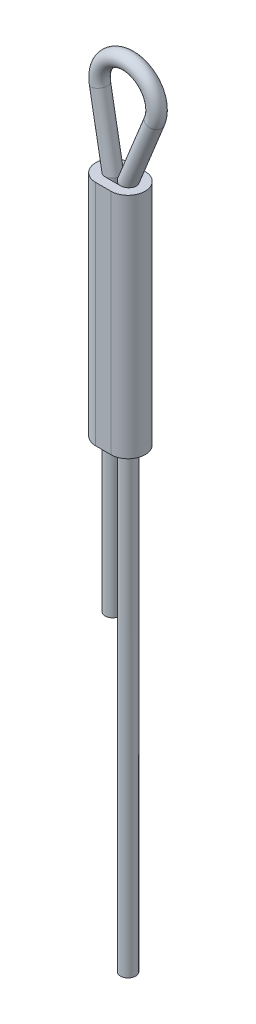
ISO-10303-21;
HEADER;
FILE_DESCRIPTION(('STEP AP214'),'2;1');
FILE_NAME('part.step','',(''),(''),'','','');
FILE_SCHEMA(('AUTOMOTIVE_DESIGN { 1 0 10303 214 1 1 1 1 }'));
ENDSEC;
DATA;
#1=APPLICATION_CONTEXT('core data for automotive mechanical design processes');
#2=APPLICATION_PROTOCOL_DEFINITION('international standard','automotive_design',2000,#1);
#3=PRODUCT_CONTEXT('',#1,'mechanical');
#4=PRODUCT('Part','Part','',(#3));
#5=PRODUCT_RELATED_PRODUCT_CATEGORY('part','',(#4));
#6=PRODUCT_DEFINITION_FORMATION('','',#4);
#7=PRODUCT_DEFINITION_CONTEXT('part definition',#1,'design');
#8=PRODUCT_DEFINITION('design','',#6,#7);
#9=PRODUCT_DEFINITION_SHAPE('','',#8);
#10=(LENGTH_UNIT() NAMED_UNIT(*) SI_UNIT(.MILLI.,.METRE.));
#11=(NAMED_UNIT(*) PLANE_ANGLE_UNIT() SI_UNIT($,.RADIAN.));
#12=(NAMED_UNIT(*) SI_UNIT($,.STERADIAN.) SOLID_ANGLE_UNIT());
#13=UNCERTAINTY_MEASURE_WITH_UNIT(LENGTH_MEASURE(1.E-05),#10,'distance_accuracy_value','');
#14=(GEOMETRIC_REPRESENTATION_CONTEXT(3) GLOBAL_UNCERTAINTY_ASSIGNED_CONTEXT((#13)) GLOBAL_UNIT_ASSIGNED_CONTEXT((#10,
#11,#12)) REPRESENTATION_CONTEXT('',''));
#15=CARTESIAN_POINT('',(0.,0.,0.));
#16=DIRECTION('',(0.,0.,1.));
#17=DIRECTION('',(1.,0.,0.));
#18=AXIS2_PLACEMENT_3D('',#15,#16,#17);
#19=CARTESIAN_POINT('',(-0.399999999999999,-8.,0.));
#20=DIRECTION('',(0.,-1.,0.));
#21=DIRECTION('',(1.,0.,0.));
#22=AXIS2_PLACEMENT_3D('',#19,#20,#21);
#23=PLANE('',#22);
#24=CARTESIAN_POINT('',(-0.399999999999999,-8.,0.));
#25=DIRECTION('',(0.,-1.,0.));
#26=DIRECTION('',(1.,0.,0.));
#27=AXIS2_PLACEMENT_3D('',#24,#25,#26);
#28=CIRCLE('',#27,0.45);
#29=CARTESIAN_POINT('',(-0.399999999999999,-8.,0.45));
#30=VERTEX_POINT('',#29);
#31=CARTESIAN_POINT('',(-0.399999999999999,-8.,-0.45));
#32=VERTEX_POINT('',#31);
#33=EDGE_CURVE('E150',#30,#32,#28,.T.);
#34=ORIENTED_EDGE('',*,*,#33,.T.);
#35=DIRECTION('',(1.,0.,0.));
#36=VECTOR('',#35,1.);
#37=CARTESIAN_POINT('',(-0.399999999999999,-8.,-0.45));
#38=LINE('',#37,#36);
#39=CARTESIAN_POINT('',(0.,-8.,-0.45));
#40=VERTEX_POINT('',#39);
#41=EDGE_CURVE('E153',#32,#40,#38,.T.);
#42=ORIENTED_EDGE('',*,*,#41,.T.);
#43=CARTESIAN_POINT('',(0.,-8.,0.));
#44=DIRECTION('',(0.,-1.,0.));
#45=DIRECTION('',(1.,0.,0.));
#46=AXIS2_PLACEMENT_3D('',#43,#44,#45);
#47=CIRCLE('',#46,0.45);
#48=CARTESIAN_POINT('',(0.,-8.,0.45));
#49=VERTEX_POINT('',#48);
#50=EDGE_CURVE('E156',#40,#49,#47,.T.);
#51=ORIENTED_EDGE('',*,*,#50,.T.);
#52=DIRECTION('',(-1.,0.,0.));
#53=VECTOR('',#52,1.);
#54=CARTESIAN_POINT('',(-0.399999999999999,-8.,0.45));
#55=LINE('',#54,#53);
#56=EDGE_CURVE('E158',#49,#30,#55,.T.);
#57=ORIENTED_EDGE('',*,*,#56,.T.);
#58=EDGE_LOOP('',(#34,#42,#51,#57));
#59=FACE_BOUND('',#58,.T.);
#60=DIRECTION('',(1.,0.,0.));
#61=VECTOR('',#60,1.);
#62=CARTESIAN_POINT('',(-0.399999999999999,-8.,-0.2));
#63=LINE('',#62,#61);
#64=CARTESIAN_POINT('',(-0.399999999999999,-8.,-0.2));
#65=VERTEX_POINT('',#64);
#66=CARTESIAN_POINT('',(0.,-8.,-0.2));
#67=VERTEX_POINT('',#66);
#68=EDGE_CURVE('E122',#65,#67,#63,.T.);
#69=ORIENTED_EDGE('',*,*,#68,.F.);
#70=CARTESIAN_POINT('',(-0.399999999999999,-8.,0.));
#71=DIRECTION('',(0.,-1.,0.));
#72=DIRECTION('',(1.,0.,0.));
#73=AXIS2_PLACEMENT_3D('',#70,#71,#72);
#74=CIRCLE('',#73,0.2);
#75=CARTESIAN_POINT('',(-0.399999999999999,-8.,0.2));
#76=VERTEX_POINT('',#75);
#77=EDGE_CURVE('E114',#76,#65,#74,.T.);
#78=ORIENTED_EDGE('',*,*,#77,.F.);
#79=DIRECTION('',(-1.,0.,0.));
#80=VECTOR('',#79,1.);
#81=CARTESIAN_POINT('',(-0.399999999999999,-8.,0.2));
#82=LINE('',#81,#80);
#83=CARTESIAN_POINT('',(0.,-8.,0.2));
#84=VERTEX_POINT('',#83);
#85=EDGE_CURVE('E136',#84,#76,#82,.T.);
#86=ORIENTED_EDGE('',*,*,#85,.F.);
#87=CARTESIAN_POINT('',(0.,-8.,0.));
#88=DIRECTION('',(0.,-1.,0.));
#89=DIRECTION('',(1.,0.,0.));
#90=AXIS2_PLACEMENT_3D('',#87,#88,#89);
#91=CIRCLE('',#90,0.2);
#92=EDGE_CURVE('E134',#67,#84,#91,.T.);
#93=ORIENTED_EDGE('',*,*,#92,.F.);
#94=EDGE_LOOP('',(#69,#78,#86,#93));
#95=FACE_BOUND('',#94,.T.);
#96=ADVANCED_FACE('F49',(#59,#95),#23,.T.);
#97=CARTESIAN_POINT('',(-0.4,-2.,0.));
#98=DIRECTION('',(0.,-1.,0.));
#99=DIRECTION('',(1.,0.,0.));
#100=AXIS2_PLACEMENT_3D('',#97,#98,#99);
#101=PLANE('',#100);
#102=CARTESIAN_POINT('',(-0.4,-2.,0.));
#103=DIRECTION('',(0.,-1.,0.));
#104=DIRECTION('',(1.,0.,0.));
#105=AXIS2_PLACEMENT_3D('',#102,#103,#104);
#106=CIRCLE('',#105,0.45);
#107=CARTESIAN_POINT('',(-0.4,-2.,0.45));
#108=VERTEX_POINT('',#107);
#109=CARTESIAN_POINT('',(-0.4,-2.,-0.45));
#110=VERTEX_POINT('',#109);
#111=EDGE_CURVE('E130',#108,#110,#106,.T.);
#112=ORIENTED_EDGE('',*,*,#111,.F.);
#113=DIRECTION('',(-1.,0.,0.));
#114=VECTOR('',#113,1.);
#115=CARTESIAN_POINT('',(-0.4,-2.,0.45));
#116=LINE('',#115,#114);
#117=CARTESIAN_POINT('',(0.,-2.,0.45));
#118=VERTEX_POINT('',#117);
#119=EDGE_CURVE('E154',#118,#108,#116,.T.);
#120=ORIENTED_EDGE('',*,*,#119,.F.);
#121=CARTESIAN_POINT('',(0.,-2.,0.));
#122=DIRECTION('',(0.,-1.,0.));
#123=DIRECTION('',(1.,0.,0.));
#124=AXIS2_PLACEMENT_3D('',#121,#122,#123);
#125=CIRCLE('',#124,0.45);
#126=CARTESIAN_POINT('',(0.,-2.,-0.45));
#127=VERTEX_POINT('',#126);
#128=EDGE_CURVE('E165',#127,#118,#125,.T.);
#129=ORIENTED_EDGE('',*,*,#128,.F.);
#130=DIRECTION('',(1.,0.,0.));
#131=VECTOR('',#130,1.);
#132=CARTESIAN_POINT('',(-0.4,-2.,-0.45));
#133=LINE('',#132,#131);
#134=EDGE_CURVE('E163',#110,#127,#133,.T.);
#135=ORIENTED_EDGE('',*,*,#134,.F.);
#136=EDGE_LOOP('',(#112,#120,#129,#135));
#137=FACE_BOUND('',#136,.T.);
#138=CARTESIAN_POINT('',(-0.4,-2.,0.));
#139=DIRECTION('',(0.,-1.,0.));
#140=DIRECTION('',(1.,0.,0.));
#141=AXIS2_PLACEMENT_3D('',#138,#139,#140);
#142=CIRCLE('',#141,0.2);
#143=CARTESIAN_POINT('',(-0.4,-2.,0.2));
#144=VERTEX_POINT('',#143);
#145=CARTESIAN_POINT('',(-0.4,-2.,-0.2));
#146=VERTEX_POINT('',#145);
#147=EDGE_CURVE('E72',#144,#146,#142,.T.);
#148=ORIENTED_EDGE('',*,*,#147,.T.);
#149=DIRECTION('',(1.,0.,0.));
#150=VECTOR('',#149,1.);
#151=CARTESIAN_POINT('',(-0.4,-2.,-0.2));
#152=LINE('',#151,#150);
#153=CARTESIAN_POINT('',(0.,-2.,-0.2));
#154=VERTEX_POINT('',#153);
#155=EDGE_CURVE('E129',#146,#154,#152,.T.);
#156=ORIENTED_EDGE('',*,*,#155,.T.);
#157=CARTESIAN_POINT('',(0.,-2.,0.));
#158=DIRECTION('',(0.,-1.,0.));
#159=DIRECTION('',(1.,0.,0.));
#160=AXIS2_PLACEMENT_3D('',#157,#158,#159);
#161=CIRCLE('',#160,0.2);
#162=CARTESIAN_POINT('',(0.,-2.,0.2));
#163=VERTEX_POINT('',#162);
#164=EDGE_CURVE('E142',#154,#163,#161,.T.);
#165=ORIENTED_EDGE('',*,*,#164,.T.);
#166=DIRECTION('',(-1.,0.,0.));
#167=VECTOR('',#166,1.);
#168=CARTESIAN_POINT('',(-0.4,-2.,0.2));
#169=LINE('',#168,#167);
#170=EDGE_CURVE('E123',#163,#144,#169,.T.);
#171=ORIENTED_EDGE('',*,*,#170,.T.);
#172=EDGE_LOOP('',(#148,#156,#165,#171));
#173=FACE_BOUND('',#172,.T.);
#174=ADVANCED_FACE('F183',(#137,#173),#101,.F.);
#175=CARTESIAN_POINT('',(-0.399999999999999,-8.,0.));
#176=DIRECTION('',(0.,1.,0.));
#177=DIRECTION('',(-1.,0.,0.));
#178=AXIS2_PLACEMENT_3D('',#175,#176,#177);
#179=CYLINDRICAL_SURFACE('',#178,0.45);
#180=ORIENTED_EDGE('',*,*,#111,.T.);
#181=DIRECTION('',(0.,1.,0.));
#182=VECTOR('',#181,1.);
#183=CARTESIAN_POINT('',(-0.399999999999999,-8.,-0.45));
#184=LINE('',#183,#182);
#185=EDGE_CURVE('E13',#32,#110,#184,.T.);
#186=ORIENTED_EDGE('',*,*,#185,.F.);
#187=ORIENTED_EDGE('',*,*,#33,.F.);
#188=DIRECTION('',(0.,1.,0.));
#189=VECTOR('',#188,1.);
#190=CARTESIAN_POINT('',(-0.399999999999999,-8.,0.45));
#191=LINE('',#190,#189);
#192=EDGE_CURVE('E160',#30,#108,#191,.T.);
#193=ORIENTED_EDGE('',*,*,#192,.T.);
#194=EDGE_LOOP('',(#180,#186,#187,#193));
#195=FACE_BOUND('',#194,.T.);
#196=ADVANCED_FACE('F51',(#195),#179,.T.);
#197=CARTESIAN_POINT('',(-0.399999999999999,-8.,-0.45));
#198=DIRECTION('',(0.,0.,1.));
#199=DIRECTION('',(1.,0.,0.));
#200=AXIS2_PLACEMENT_3D('',#197,#198,#199);
#201=PLANE('',#200);
#202=ORIENTED_EDGE('',*,*,#134,.T.);
#203=DIRECTION('',(0.,1.,0.));
#204=VECTOR('',#203,1.);
#205=CARTESIAN_POINT('',(0.,-8.,-0.45));
#206=LINE('',#205,#204);
#207=EDGE_CURVE('E57',#40,#127,#206,.T.);
#208=ORIENTED_EDGE('',*,*,#207,.F.);
#209=ORIENTED_EDGE('',*,*,#41,.F.);
#210=ORIENTED_EDGE('',*,*,#185,.T.);
#211=EDGE_LOOP('',(#202,#208,#209,#210));
#212=FACE_BOUND('',#211,.T.);
#213=ADVANCED_FACE('F193',(#212),#201,.F.);
#214=CARTESIAN_POINT('',(0.,-8.,0.));
#215=DIRECTION('',(0.,1.,0.));
#216=DIRECTION('',(-1.,0.,0.));
#217=AXIS2_PLACEMENT_3D('',#214,#215,#216);
#218=CYLINDRICAL_SURFACE('',#217,0.45);
#219=ORIENTED_EDGE('',*,*,#128,.T.);
#220=DIRECTION('',(0.,1.,0.));
#221=VECTOR('',#220,1.);
#222=CARTESIAN_POINT('',(0.,-8.,0.45));
#223=LINE('',#222,#221);
#224=EDGE_CURVE('E170',#49,#118,#223,.T.);
#225=ORIENTED_EDGE('',*,*,#224,.F.);
#226=ORIENTED_EDGE('',*,*,#50,.F.);
#227=ORIENTED_EDGE('',*,*,#207,.T.);
#228=EDGE_LOOP('',(#219,#225,#226,#227));
#229=FACE_BOUND('',#228,.T.);
#230=ADVANCED_FACE('F177',(#229),#218,.T.);
#231=CARTESIAN_POINT('',(-0.399999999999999,-8.,0.45));
#232=DIRECTION('',(0.,0.,-1.));
#233=DIRECTION('',(-1.,0.,0.));
#234=AXIS2_PLACEMENT_3D('',#231,#232,#233);
#235=PLANE('',#234);
#236=ORIENTED_EDGE('',*,*,#119,.T.);
#237=ORIENTED_EDGE('',*,*,#192,.F.);
#238=ORIENTED_EDGE('',*,*,#56,.F.);
#239=ORIENTED_EDGE('',*,*,#224,.T.);
#240=EDGE_LOOP('',(#236,#237,#238,#239));
#241=FACE_BOUND('',#240,.T.);
#242=ADVANCED_FACE('F187',(#241),#235,.F.);
#243=CARTESIAN_POINT('',(-0.399999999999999,-8.,0.));
#244=DIRECTION('',(0.,1.,0.));
#245=DIRECTION('',(-1.,0.,0.));
#246=AXIS2_PLACEMENT_3D('',#243,#244,#245);
#247=CYLINDRICAL_SURFACE('',#246,0.2);
#248=ORIENTED_EDGE('',*,*,#147,.F.);
#249=DIRECTION('',(0.,1.,0.));
#250=VECTOR('',#249,1.);
#251=CARTESIAN_POINT('',(-0.399999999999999,-8.,0.2));
#252=LINE('',#251,#250);
#253=EDGE_CURVE('E118',#76,#144,#252,.T.);
#254=ORIENTED_EDGE('',*,*,#253,.F.);
#255=ORIENTED_EDGE('',*,*,#77,.T.);
#256=DIRECTION('',(0.,1.,0.));
#257=VECTOR('',#256,1.);
#258=CARTESIAN_POINT('',(-0.399999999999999,-8.,-0.2));
#259=LINE('',#258,#257);
#260=EDGE_CURVE('E117',#65,#146,#259,.T.);
#261=ORIENTED_EDGE('',*,*,#260,.T.);
#262=EDGE_LOOP('',(#248,#254,#255,#261));
#263=FACE_BOUND('',#262,.T.);
#264=ADVANCED_FACE('F116',(#263),#247,.F.);
#265=CARTESIAN_POINT('',(-0.399999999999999,-8.,-0.2));
#266=DIRECTION('',(0.,0.,1.));
#267=DIRECTION('',(1.,0.,0.));
#268=AXIS2_PLACEMENT_3D('',#265,#266,#267);
#269=PLANE('',#268);
#270=ORIENTED_EDGE('',*,*,#155,.F.);
#271=ORIENTED_EDGE('',*,*,#260,.F.);
#272=ORIENTED_EDGE('',*,*,#68,.T.);
#273=DIRECTION('',(0.,1.,0.));
#274=VECTOR('',#273,1.);
#275=CARTESIAN_POINT('',(0.,-8.,-0.2));
#276=LINE('',#275,#274);
#277=EDGE_CURVE('E131',#67,#154,#276,.T.);
#278=ORIENTED_EDGE('',*,*,#277,.T.);
#279=EDGE_LOOP('',(#270,#271,#272,#278));
#280=FACE_BOUND('',#279,.T.);
#281=ADVANCED_FACE('F126',(#280),#269,.T.);
#282=CARTESIAN_POINT('',(0.,-8.,0.));
#283=DIRECTION('',(0.,1.,0.));
#284=DIRECTION('',(-1.,0.,0.));
#285=AXIS2_PLACEMENT_3D('',#282,#283,#284);
#286=CYLINDRICAL_SURFACE('',#285,0.2);
#287=ORIENTED_EDGE('',*,*,#164,.F.);
#288=ORIENTED_EDGE('',*,*,#277,.F.);
#289=ORIENTED_EDGE('',*,*,#92,.T.);
#290=DIRECTION('',(0.,1.,0.));
#291=VECTOR('',#290,1.);
#292=CARTESIAN_POINT('',(0.,-8.,0.2));
#293=LINE('',#292,#291);
#294=EDGE_CURVE('E64',#84,#163,#293,.T.);
#295=ORIENTED_EDGE('',*,*,#294,.T.);
#296=EDGE_LOOP('',(#287,#288,#289,#295));
#297=FACE_BOUND('',#296,.T.);
#298=ADVANCED_FACE('F216',(#297),#286,.F.);
#299=CARTESIAN_POINT('',(-0.399999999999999,-8.,0.2));
#300=DIRECTION('',(0.,0.,-1.));
#301=DIRECTION('',(-1.,0.,0.));
#302=AXIS2_PLACEMENT_3D('',#299,#300,#301);
#303=PLANE('',#302);
#304=ORIENTED_EDGE('',*,*,#170,.F.);
#305=ORIENTED_EDGE('',*,*,#294,.F.);
#306=ORIENTED_EDGE('',*,*,#85,.T.);
#307=ORIENTED_EDGE('',*,*,#253,.T.);
#308=EDGE_LOOP('',(#304,#305,#306,#307));
#309=FACE_BOUND('',#308,.T.);
#310=ADVANCED_FACE('F220',(#309),#303,.T.);
#311=CLOSED_SHELL('',(#96,#174,#196,#213,#230,#242,#264,#281,#298,#310));
#312=MANIFOLD_SOLID_BREP('B2',#311);
#313=CARTESIAN_POINT('',(0.,-2.,0.));
#314=DIRECTION('',(0.,-1.,0.));
#315=DIRECTION('',(1.,0.,0.));
#316=AXIS2_PLACEMENT_3D('',#313,#314,#315);
#317=CYLINDRICAL_SURFACE('',#316,0.2);
#318=CARTESIAN_POINT('',(0.,-2.,0.));
#319=DIRECTION('',(-0.191017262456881,-0.981586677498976,0.));
#320=DIRECTION('',(-0.981586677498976,0.191017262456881,0.));
#321=AXIS2_PLACEMENT_3D('',#318,#319,#320);
#322=ELLIPSE('',#321,0.203751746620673,0.2);
#323=CARTESIAN_POINT('',(-0.2,-1.96107989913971,0.));
#324=VERTEX_POINT('',#323);
#325=EDGE_CURVE('E284',#324,#324,#322,.F.);
#326=ORIENTED_EDGE('',*,*,#325,.F.);
#327=EDGE_LOOP('',(#326));
#328=FACE_BOUND('',#327,.T.);
#329=CARTESIAN_POINT('',(0.,-20.,0.));
#330=DIRECTION('',(0.,-1.,0.));
#331=DIRECTION('',(1.,0.,0.));
#332=AXIS2_PLACEMENT_3D('',#329,#330,#331);
#333=CIRCLE('',#332,0.2);
#334=CARTESIAN_POINT('',(0.200000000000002,-20.,0.));
#335=VERTEX_POINT('',#334);
#336=EDGE_CURVE('E48',#335,#335,#333,.T.);
#337=ORIENTED_EDGE('',*,*,#336,.F.);
#338=EDGE_LOOP('',(#337));
#339=FACE_BOUND('',#338,.T.);
#340=ADVANCED_FACE('F278',(#328,#339),#317,.T.);
#341=CARTESIAN_POINT('',(0.695268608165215,-0.28125000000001,0.));
#342=DIRECTION('',(-0.375,-0.927024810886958,0.));
#343=DIRECTION('',(0.927024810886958,-0.375,0.));
#344=AXIS2_PLACEMENT_3D('',#341,#342,#343);
#345=CYLINDRICAL_SURFACE('',#344,0.2);
#346=CARTESIAN_POINT('',(0.695268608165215,-0.28125000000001,0.));
#347=DIRECTION('',(-0.375000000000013,-0.927024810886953,0.));
#348=DIRECTION('',(0.927024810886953,-0.375000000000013,0.));
#349=AXIS2_PLACEMENT_3D('',#346,#347,#348);
#350=CIRCLE('',#349,0.2);
#351=CARTESIAN_POINT('',(0.880673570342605,-0.356250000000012,0.));
#352=VERTEX_POINT('',#351);
#353=EDGE_CURVE('E288',#352,#352,#350,.T.);
#354=ORIENTED_EDGE('',*,*,#353,.T.);
#355=EDGE_LOOP('',(#354));
#356=FACE_BOUND('',#355,.T.);
#357=ORIENTED_EDGE('',*,*,#325,.T.);
#358=EDGE_LOOP('',(#357));
#359=FACE_BOUND('',#358,.T.);
#360=ADVANCED_FACE('F322',(#356,#359),#345,.T.);
#361=CARTESIAN_POINT('',(0.,0.,0.));
#362=DIRECTION('',(0.,0.,-1.));
#363=DIRECTION('',(-1.,0.,0.));
#364=AXIS2_PLACEMENT_3D('',#361,#362,#363);
#365=TOROIDAL_SURFACE('',#364,0.75,0.2);
#366=CARTESIAN_POINT('',(-0.737995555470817,-0.133650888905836,0.));
#367=DIRECTION('',(-0.178201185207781,0.98399407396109,0.));
#368=DIRECTION('',(-0.98399407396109,-0.178201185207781,0.));
#369=AXIS2_PLACEMENT_3D('',#366,#367,#368);
#370=CIRCLE('',#369,0.2);
#371=CARTESIAN_POINT('',(-0.934794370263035,-0.169291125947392,0.));
#372=VERTEX_POINT('',#371);
#373=EDGE_CURVE('E292',#372,#372,#370,.T.);
#374=CARTESIAN_POINT('',(0.,0.,0.));
#375=DIRECTION('',(0.,0.,-1.));
#376=DIRECTION('',(-1.,0.,0.));
#377=AXIS2_PLACEMENT_3D('',#374,#375,#376);
#378=CIRCLE('',#377,0.95);
#379=EDGE_CURVE('',#372,#352,#378,.T.);
#380=ORIENTED_EDGE('',*,*,#373,.T.);
#381=ORIENTED_EDGE('',*,*,#353,.F.);
#382=ORIENTED_EDGE('',*,*,#379,.T.);
#383=ORIENTED_EDGE('',*,*,#379,.F.);
#384=EDGE_LOOP('',(#380,#382,#381,#383));
#385=FACE_BOUND('',#384,.T.);
#386=ADVANCED_FACE('F316',(#385),#365,.T.);
#387=CARTESIAN_POINT('',(-0.4,-2.,0.));
#388=DIRECTION('',(-0.178201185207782,0.983994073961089,0.));
#389=DIRECTION('',(-0.983994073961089,-0.178201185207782,0.));
#390=AXIS2_PLACEMENT_3D('',#387,#388,#389);
#391=CYLINDRICAL_SURFACE('',#390,0.2);
#392=CARTESIAN_POINT('',(-0.4,-2.,0.));
#393=DIRECTION('',(-0.0894592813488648,0.995990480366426,0.));
#394=DIRECTION('',(-0.995990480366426,-0.0894592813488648,0.));
#395=AXIS2_PLACEMENT_3D('',#392,#393,#394);
#396=ELLIPSE('',#395,0.200805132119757,0.2);
#397=CARTESIAN_POINT('',(-0.6,-2.0179638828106,0.));
#398=VERTEX_POINT('',#397);
#399=EDGE_CURVE('E297',#398,#398,#396,.F.);
#400=ORIENTED_EDGE('',*,*,#399,.F.);
#401=EDGE_LOOP('',(#400));
#402=FACE_BOUND('',#401,.T.);
#403=ORIENTED_EDGE('',*,*,#373,.F.);
#404=EDGE_LOOP('',(#403));
#405=FACE_BOUND('',#404,.T.);
#406=ADVANCED_FACE('F313',(#402,#405),#391,.T.);
#407=CARTESIAN_POINT('',(-0.399999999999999,-12.,0.));
#408=DIRECTION('',(0.,-1.,0.));
#409=DIRECTION('',(1.,0.,0.));
#410=AXIS2_PLACEMENT_3D('',#407,#408,#409);
#411=PLANE('',#410);
#412=CARTESIAN_POINT('',(-0.399999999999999,-12.,0.));
#413=DIRECTION('',(0.,-1.,0.));
#414=DIRECTION('',(1.,0.,0.));
#415=AXIS2_PLACEMENT_3D('',#412,#413,#414);
#416=CIRCLE('',#415,0.2);
#417=CARTESIAN_POINT('',(-0.199999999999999,-12.,0.));
#418=VERTEX_POINT('',#417);
#419=EDGE_CURVE('E300',#418,#418,#416,.T.);
#420=ORIENTED_EDGE('',*,*,#419,.T.);
#421=EDGE_LOOP('',(#420));
#422=FACE_BOUND('',#421,.T.);
#423=ADVANCED_FACE('F304',(#422),#411,.T.);
#424=CARTESIAN_POINT('',(-0.4,-1.43431457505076,0.));
#425=DIRECTION('',(0.,-1.,0.));
#426=DIRECTION('',(1.,0.,0.));
#427=AXIS2_PLACEMENT_3D('',#424,#425,#426);
#428=CYLINDRICAL_SURFACE('',#427,0.2);
#429=ORIENTED_EDGE('',*,*,#419,.F.);
#430=EDGE_LOOP('',(#429));
#431=FACE_BOUND('',#430,.T.);
#432=ORIENTED_EDGE('',*,*,#399,.T.);
#433=EDGE_LOOP('',(#432));
#434=FACE_BOUND('',#433,.T.);
#435=ADVANCED_FACE('F306',(#431,#434),#428,.T.);
#436=CARTESIAN_POINT('',(0.,-20.,0.));
#437=DIRECTION('',(0.,-1.,0.));
#438=DIRECTION('',(1.,0.,0.));
#439=AXIS2_PLACEMENT_3D('',#436,#437,#438);
#440=PLANE('',#439);
#441=ORIENTED_EDGE('',*,*,#336,.T.);
#442=EDGE_LOOP('',(#441));
#443=FACE_BOUND('',#442,.T.);
#444=ADVANCED_FACE('F309',(#443),#440,.T.);
#445=CLOSED_SHELL('',(#340,#360,#386,#406,#423,#435,#444));
#446=MANIFOLD_SOLID_BREP('B7',#445);
#447=ADVANCED_BREP_SHAPE_REPRESENTATION('',(#18,#312,#446),#14);
#448=SHAPE_DEFINITION_REPRESENTATION(#9,#447);
ENDSEC;
END-ISO-10303-21;
